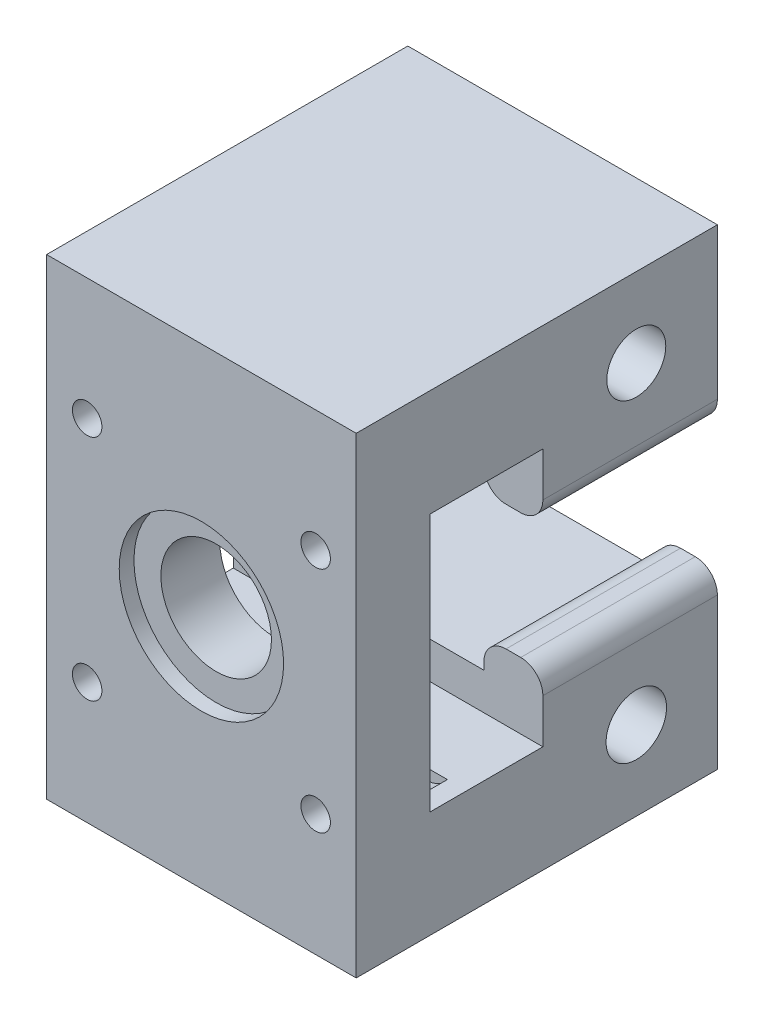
from build123d import *

# Parameters (mm, degrees)
ESQUISSE1_W              = 42
ESQUISSE1_H              = 64
BOSS_EXTRU_1_DEPTH       = 10
ESQUISSE2_W              = 42
ESQUISSE2_H              = 18
BOSS_EXTRU_2_DEPTH       = 25
ESQUISSE3_W              = 42
ESQUISSE3_H              = 18
BOSS_EXTRU_3_DEPTH       = 25
ESQUISSE5_R              = 11.15
ENL_V_MAT_EXTRU_2_DEPTH  = 2.5
ESQUISSE6_R              = 3.5
ENL_V_MAT_EXTRU_3_DEPTH  = 94.5370698
ESQUISSE7_W              = 5.323475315
ESQUISSE7_H              = 35
ENL_V_MAT_EXTRU_4_DEPTH  = 67.516673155
ESQUISSE8_R              = 2
ENL_V_MAT_EXTRU_5_DEPTH  = 12.5
ESQUISSE9_R              = 4
ESQUISSE9_R_2            = 4.1
ENL_V_MAT_EXTRU_7_DEPTH  = 67.516673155
ESQUISSE10_R             = 7
ENL_V_MAT_EXTRU_8_DEPTH  = 94.5370698
ESQUISSE11_R             = 8
ENL_V_MAT_EXTRU_9_DEPTH  = 10
ESQUISSE14_W             = 42
ESQUISSE14_H             = 18
BOSS_EXTRU_4_DEPTH       = 4
ESQUISSE15_W             = 42
ESQUISSE15_H             = 18
BOSS_EXTRU_5_DEPTH       = 4
ESQUISSE17_W             = 42
ESQUISSE17_H             = 23.676524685
BOSS_EXTRU_7_DEPTH       = 1.5
ESQUISSE18_W             = 42
ESQUISSE18_H             = 23.676524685
BOSS_EXTRU_8_DEPTH       = 1.5
ESQUISSE19_W             = 8
ESQUISSE19_H             = 23.676524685
BOSS_EXTRU_9_DEPTH       = 4
ESQUISSE20_W             = 8
ESQUISSE20_H             = 23.676524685
BOSS_EXTRU_10_DEPTH      = 4
ESQUISSE21_W             = 8
ESQUISSE21_H             = 23.676524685
BOSS_EXTRU_11_DEPTH      = 4
ESQUISSE22_W             = 8
ESQUISSE22_H             = 23.676524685
BOSS_EXTRU_12_DEPTH      = 4
CONG_2_R                 = 3
CONG_3_R                 = 3
CONG_4_R                 = 3
CONG_5_R                 = 3
CONG_6_R                 = 3
CONG_7_R                 = 3
CONG_8_R                 = 3
CONG_9_R                 = 3
ESQUISSE23_W             = 42
ESQUISSE23_H             = 64
BOSS_EXTRU_13_DEPTH      = 10
ESQUISSE24_W             = 42
ESQUISSE24_H             = 35
ENL_V_MAT_EXTRU_10_DEPTH = 10
ESQUISSE26_R             = 11.15
ENL_V_MAT_EXTRU_11_DEPTH = 2
ESQUISSE27_R             = 7.5
ENL_V_MAT_EXTRU_12_DEPTH = 100.508459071
ESQUISSE29_W             = 17.273227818
ESQUISSE29_H             = 30.328460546
ENL_V_MAT_EXTRU_14_DEPTH = 4
ESQUISSE30_W             = 15.55223471
ESQUISSE30_H             = 26.98938317
ENL_V_MAT_EXTRU_15_DEPTH = 4
ESQUISSE28_R             = 2
ENL_V_MAT_EXTRU_16_DEPTH = 10
ESQUISSE31_R             = 3.447480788
ESQUISSE31_R_2           = 3.5
ENL_V_MAT_EXTRU_17_DEPTH = 5


with BuildPart() as part:
    # Esquisse1 → Boss.-Extru.1 (new body)
    with BuildSketch(Plane.XY):
        with Locations((54.216126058, -13.116159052)):
            Rectangle(ESQUISSE1_W, ESQUISSE1_H)
    extrude(amount=BOSS_EXTRU_1_DEPTH)

    # Esquisse2 → Boss.-Extru.2 (add)
    with BuildSketch(Plane(origin=(0, 0, 0), x_dir=(-1, 0, 0), z_dir=(0, 0, -1))):
        with Locations((-54.216126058, 9.883840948)):
            Rectangle(ESQUISSE2_W, ESQUISSE2_H)
    extrude(amount=BOSS_EXTRU_2_DEPTH)

    # Esquisse3 → Boss.-Extru.3 (add)
    with BuildSketch(Plane(origin=(0, 0, 0), x_dir=(-1, 0, 0), z_dir=(0, 0, -1))):
        with Locations((-54.216126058, -36.116159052)):
            Rectangle(ESQUISSE3_W, ESQUISSE3_H)
    extrude(amount=BOSS_EXTRU_3_DEPTH)

    # Esquisse5 → Enl_v. mat.-Extru.2 (cut)
    with BuildSketch(Plane.XY.offset(10)):
        with Locations((54.216126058, -13.116159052)):
            Circle(ESQUISSE5_R)
    extrude(amount=-ENL_V_MAT_EXTRU_2_DEPTH, mode=Mode.SUBTRACT)

    # Esquisse6 → Enl_v. mat.-Extru.3 (cut, through all)
    with BuildSketch(Plane.XY.offset(7.5)):
        with Locations((54.216126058, -13.116159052)):
            Circle(ESQUISSE6_R)
    extrude(amount=-ENL_V_MAT_EXTRU_3_DEPTH, mode=Mode.SUBTRACT)

    # Esquisse7 → Enl_v. mat.-Extru.4 (cut, through all)
    with BuildSketch(Plane.ZY.offset(-33.216126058)):
        with Locations((-2.661737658, -13.116159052)):
            Rectangle(ESQUISSE7_W, ESQUISSE7_H)
    extrude(amount=-ENL_V_MAT_EXTRU_4_DEPTH, mode=Mode.SUBTRACT)

    # Esquisse8 → Enl_v. mat.-Extru.5 (cut)
    with BuildSketch(Plane.XY.offset(10)):
        with Locations((38.716126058, 2.383840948)):
            Circle(ESQUISSE8_R)
        with Locations((38.716126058, -28.616159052)):
            Circle(ESQUISSE8_R)
        with Locations((69.716126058, -28.616159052)):
            Circle(ESQUISSE8_R)
        with Locations((69.716126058, 2.383840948)):
            Circle(ESQUISSE8_R)
    extrude(amount=-ENL_V_MAT_EXTRU_5_DEPTH, mode=Mode.SUBTRACT)

    # Esquisse9 → Enl_v. mat.-Extru.7 (cut, through all)
    with BuildSketch(Plane(origin=(75.216126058, 0, 0), x_dir=(0, 0, -1), z_dir=(1, 0, 0))):
        with Locations((18, 8.133840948)):
            Circle(ESQUISSE9_R)
        with Locations((18, -34.366159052)):
            Circle(ESQUISSE9_R_2)
    extrude(amount=-ENL_V_MAT_EXTRU_7_DEPTH, mode=Mode.SUBTRACT)

    # Esquisse10 → Enl_v. mat.-Extru.8 (cut, through all)
    with BuildSketch(Plane.XY.offset(7.5)):
        with Locations((54.216126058, -13.116159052)):
            Circle(ESQUISSE10_R)
    extrude(amount=-ENL_V_MAT_EXTRU_8_DEPTH, mode=Mode.SUBTRACT)

    # Esquisse11 → Enl_v. mat.-Extru.9 (cut)
    with BuildSketch(Plane.XY.offset(7.5)):
        with Locations((54.216126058, -13.116159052)):
            Circle(ESQUISSE11_R)
    extrude(amount=-ENL_V_MAT_EXTRU_9_DEPTH, mode=Mode.SUBTRACT)

    # Esquisse14 → Boss.-Extru.4 (add)
    with BuildSketch(Plane(origin=(0, 0, -25), x_dir=(-1, 0, 0), z_dir=(0, 0, -1))):
        with Locations((-54.216126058, -36.116159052)):
            Rectangle(ESQUISSE14_W, ESQUISSE14_H)
    extrude(amount=BOSS_EXTRU_4_DEPTH)

    # Esquisse15 → Boss.-Extru.5 (add)
    with BuildSketch(Plane(origin=(0, 0, -25), x_dir=(-1, 0, 0), z_dir=(0, 0, -1))):
        with Locations((-54.216126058, 9.883840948)):
            Rectangle(ESQUISSE15_W, ESQUISSE15_H)
    extrude(amount=BOSS_EXTRU_5_DEPTH)

    # Esquisse17 → Boss.-Extru.7 (add)
    with BuildSketch(Plane(origin=(0, 0.883840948, 0), x_dir=(-1, 0, 0), z_dir=(0, -1, 0))):
        with Locations((-54.216126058, 17.161737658)):
            Rectangle(ESQUISSE17_W, ESQUISSE17_H)
    extrude(amount=BOSS_EXTRU_7_DEPTH)

    # Esquisse18 → Boss.-Extru.8 (add)
    with BuildSketch(Plane(origin=(0, -27.116159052, 0), x_dir=(1, 0, 0), z_dir=(0, 1, 0))):
        with Locations((54.216126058, 17.161737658)):
            Rectangle(ESQUISSE18_W, ESQUISSE18_H)
    extrude(amount=BOSS_EXTRU_8_DEPTH)

    # Esquisse19 → Boss.-Extru.9 (add)
    with BuildSketch(Plane.XZ.offset(0.616159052)):
        with Locations((71.216126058, -17.161737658)):
            Rectangle(ESQUISSE19_W, ESQUISSE19_H)
    extrude(amount=BOSS_EXTRU_9_DEPTH)

    # Esquisse20 → Boss.-Extru.10 (add)
    with BuildSketch(Plane.XZ.offset(0.616159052)):
        with Locations((37.216126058, -17.161737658)):
            Rectangle(ESQUISSE20_W, ESQUISSE20_H)
    extrude(amount=BOSS_EXTRU_10_DEPTH)

    # Esquisse21 → Boss.-Extru.11 (add)
    with BuildSketch(Plane(origin=(0, -25.616159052, 0), x_dir=(1, 0, 0), z_dir=(0, 1, 0))):
        with Locations((71.216126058, 17.161737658)):
            Rectangle(ESQUISSE21_W, ESQUISSE21_H)
    extrude(amount=BOSS_EXTRU_11_DEPTH)

    # Esquisse22 → Boss.-Extru.12 (add)
    with BuildSketch(Plane(origin=(0, -25.616159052, 0), x_dir=(1, 0, 0), z_dir=(0, 1, 0))):
        with Locations((37.216126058, 17.161737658)):
            Rectangle(ESQUISSE22_W, ESQUISSE22_H)
    extrude(amount=BOSS_EXTRU_12_DEPTH)

    # Cong_2
    cong_2_edges = [part.edges().sort_by_distance(p)[0] for p in [
        (75.216126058, -21.616159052, -17.161737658),
    ]]
    fillet(cong_2_edges, radius=CONG_2_R)

    # Cong_3
    cong_3_edges = [part.edges().sort_by_distance(p)[0] for p in [
        (67.216126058, -21.616159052, -17.161737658),
    ]]
    fillet(cong_3_edges, radius=CONG_3_R)

    # Cong_4
    cong_4_edges = [part.edges().sort_by_distance(p)[0] for p in [
        (67.216126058, -4.616159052, -17.161737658),
    ]]
    fillet(cong_4_edges, radius=CONG_4_R)

    # Cong_5
    cong_5_edges = [part.edges().sort_by_distance(p)[0] for p in [
        (75.216126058, -4.616159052, -17.161737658),
    ]]
    fillet(cong_5_edges, radius=CONG_5_R)

    # Cong_6
    cong_6_edges = [part.edges().sort_by_distance(p)[0] for p in [
        (33.216126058, -4.616159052, -17.161737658),
    ]]
    fillet(cong_6_edges, radius=CONG_6_R)

    # Cong_7
    cong_7_edges = [part.edges().sort_by_distance(p)[0] for p in [
        (41.216126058, -4.616159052, -17.161737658),
    ]]
    fillet(cong_7_edges, radius=CONG_7_R)

    # Cong_8
    cong_8_edges = [part.edges().sort_by_distance(p)[0] for p in [
        (33.216126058, -21.616159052, -17.161737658),
    ]]
    fillet(cong_8_edges, radius=CONG_8_R)

    # Cong_9
    cong_9_edges = [part.edges().sort_by_distance(p)[0] for p in [
        (41.216126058, -21.616159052, -17.161737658),
    ]]
    fillet(cong_9_edges, radius=CONG_9_R)

    # Esquisse23 → Boss.-Extru.13 (add)
    with BuildSketch(Plane.XY.offset(10)):
        with Locations((54.216126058, -13.116159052)):
            Rectangle(ESQUISSE23_W, ESQUISSE23_H)
    extrude(amount=BOSS_EXTRU_13_DEPTH)

    # Esquisse24 → Enl_v. mat.-Extru.10 (cut)
    with BuildSketch(Plane(origin=(0, 0, 0), x_dir=(-1, 0, 0), z_dir=(0, 0, -1))):
        with Locations((-54.216126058, -13.116159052)):
            Rectangle(ESQUISSE24_W, ESQUISSE24_H)
    extrude(amount=-ENL_V_MAT_EXTRU_10_DEPTH, mode=Mode.SUBTRACT)

    # Esquisse26 → Enl_v. mat.-Extru.11 (cut)
    with BuildSketch(Plane.XY.offset(20)):
        with Locations((54.216126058, -13.116159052)):
            Circle(ESQUISSE26_R)
    extrude(amount=-ENL_V_MAT_EXTRU_11_DEPTH, mode=Mode.SUBTRACT)

    # Esquisse27 → Enl_v. mat.-Extru.12 (cut, through all)
    with BuildSketch(Plane.XY.offset(18)):
        with Locations((54.216126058, -13.116159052)):
            Circle(ESQUISSE27_R)
    extrude(amount=-ENL_V_MAT_EXTRU_12_DEPTH, mode=Mode.SUBTRACT)

    # Esquisse29 → Enl_v. mat.-Extru.14 (cut)
    with BuildSketch(Plane(origin=(0, -21.616159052, 0), x_dir=(1, 0, 0), z_dir=(0, 1, 0))):
        with Locations((36.503167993, 18.723969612)):
            Rectangle(ESQUISSE29_W, ESQUISSE29_H)
    extrude(amount=-ENL_V_MAT_EXTRU_14_DEPTH, mode=Mode.SUBTRACT)

    # Esquisse30 → Enl_v. mat.-Extru.15 (cut)
    with BuildSketch(Plane.XZ.offset(4.616159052)):
        with Locations((36.77322033, -16.96692325)):
            Rectangle(ESQUISSE30_W, ESQUISSE30_H)
    extrude(amount=-ENL_V_MAT_EXTRU_15_DEPTH, mode=Mode.SUBTRACT)

    # Esquisse28 → Enl_v. mat.-Extru.16 (cut)
    with BuildSketch(Plane.XY.offset(20)):
        with Locations((38.716126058, -28.616159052)):
            Circle(ESQUISSE28_R)
        with Locations((38.716126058, 2.383840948)):
            Circle(ESQUISSE28_R)
        with Locations((69.716126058, 2.383840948)):
            Circle(ESQUISSE28_R)
        with Locations((69.716126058, -28.616159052)):
            Circle(ESQUISSE28_R)
    extrude(amount=-ENL_V_MAT_EXTRU_16_DEPTH, mode=Mode.SUBTRACT)

    # Esquisse31 → Enl_v. mat.-Extru.17 (cut)
    with BuildSketch(Plane(origin=(0, 0, 10), x_dir=(-1, 0, 0), z_dir=(0, 0, -1))):
        with Locations((-69.716126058, 2.383840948)):
            Circle(ESQUISSE31_R)
        with Locations((-38.716126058, 2.383840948)):
            Circle(ESQUISSE31_R_2)
        with Locations((-38.716126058, -28.616159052)):
            Circle(ESQUISSE31_R_2)
        with Locations((-69.716126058, -28.616159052)):
            Circle(ESQUISSE31_R_2)
    extrude(amount=ENL_V_MAT_EXTRU_17_DEPTH, mode=Mode.SUBTRACT)


solid = part.part
